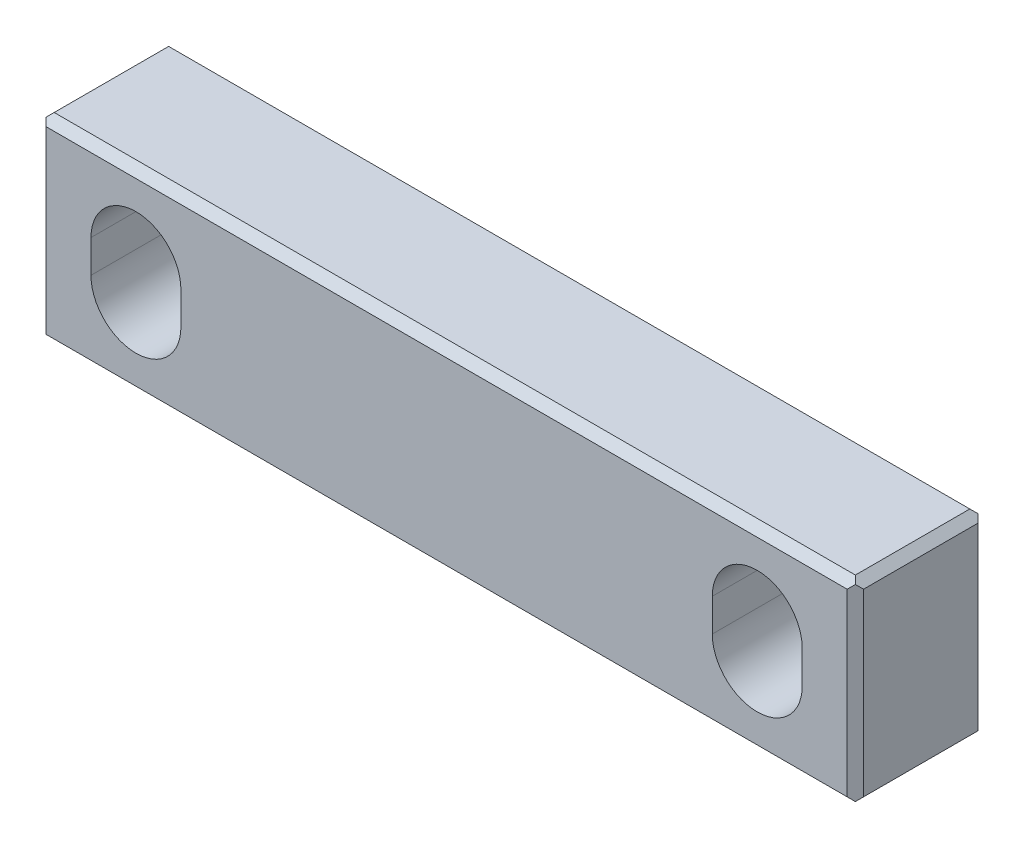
ISO-10303-21;
HEADER;
FILE_DESCRIPTION(('STEP AP214'),'2;1');
FILE_NAME('part.step','',(''),(''),'','','');
FILE_SCHEMA(('AUTOMOTIVE_DESIGN { 1 0 10303 214 1 1 1 1 }'));
ENDSEC;
DATA;
#1=APPLICATION_CONTEXT('core data for automotive mechanical design processes');
#2=APPLICATION_PROTOCOL_DEFINITION('international standard','automotive_design',2000,#1);
#3=PRODUCT_CONTEXT('',#1,'mechanical');
#4=PRODUCT('Part','Part','',(#3));
#5=PRODUCT_RELATED_PRODUCT_CATEGORY('part','',(#4));
#6=PRODUCT_DEFINITION_FORMATION('','',#4);
#7=PRODUCT_DEFINITION_CONTEXT('part definition',#1,'design');
#8=PRODUCT_DEFINITION('design','',#6,#7);
#9=PRODUCT_DEFINITION_SHAPE('','',#8);
#10=(LENGTH_UNIT() NAMED_UNIT(*) SI_UNIT(.MILLI.,.METRE.));
#11=(NAMED_UNIT(*) PLANE_ANGLE_UNIT() SI_UNIT($,.RADIAN.));
#12=(NAMED_UNIT(*) SI_UNIT($,.STERADIAN.) SOLID_ANGLE_UNIT());
#13=UNCERTAINTY_MEASURE_WITH_UNIT(LENGTH_MEASURE(1.E-05),#10,'distance_accuracy_value','');
#14=(GEOMETRIC_REPRESENTATION_CONTEXT(3) GLOBAL_UNCERTAINTY_ASSIGNED_CONTEXT((#13)) GLOBAL_UNIT_ASSIGNED_CONTEXT((#10,
#11,#12)) REPRESENTATION_CONTEXT('',''));
#15=CARTESIAN_POINT('',(0.,0.,0.));
#16=DIRECTION('',(0.,0.,1.));
#17=DIRECTION('',(1.,0.,0.));
#18=AXIS2_PLACEMENT_3D('',#15,#16,#17);
#19=CARTESIAN_POINT('',(396.970096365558,-9.9,173.27));
#20=DIRECTION('',(0.707106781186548,0.,-0.707106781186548));
#21=DIRECTION('',(-0.707106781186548,0.,-0.707106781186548));
#22=AXIS2_PLACEMENT_3D('',#19,#20,#21);
#23=PLANE('',#22);
#24=DIRECTION('',(-0.577350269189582,0.577350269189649,-0.577350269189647));
#25=VECTOR('',#24,1.);
#26=CARTESIAN_POINT('',(397.220096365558,-4.4,173.52));
#27=LINE('',#26,#25);
#28=CARTESIAN_POINT('',(397.220096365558,-4.4,173.52));
#29=VERTEX_POINT('',#28);
#30=CARTESIAN_POINT('',(396.970096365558,-4.15,173.27));
#31=VERTEX_POINT('',#30);
#32=EDGE_CURVE('E293',#29,#31,#27,.T.);
#33=ORIENTED_EDGE('',*,*,#32,.T.);
#34=DIRECTION('',(0.577350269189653,0.577350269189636,0.577350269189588));
#35=VECTOR('',#34,1.);
#36=CARTESIAN_POINT('',(396.720096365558,-4.4,173.02));
#37=LINE('',#36,#35);
#38=CARTESIAN_POINT('',(396.720096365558,-4.4,173.02));
#39=VERTEX_POINT('',#38);
#40=EDGE_CURVE('E300',#39,#31,#37,.T.);
#41=ORIENTED_EDGE('',*,*,#40,.F.);
#42=DIRECTION('',(0.,-1.,0.));
#43=VECTOR('',#42,1.);
#44=CARTESIAN_POINT('',(396.720096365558,-3.9,173.02));
#45=LINE('',#44,#43);
#46=CARTESIAN_POINT('',(396.720096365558,-15.4,173.02));
#47=VERTEX_POINT('',#46);
#48=EDGE_CURVE('E230',#47,#39,#45,.F.);
#49=ORIENTED_EDGE('',*,*,#48,.F.);
#50=DIRECTION('',(0.577350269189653,-0.577350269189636,0.577350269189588));
#51=VECTOR('',#50,1.);
#52=CARTESIAN_POINT('',(396.720096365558,-15.4,173.02));
#53=LINE('',#52,#51);
#54=CARTESIAN_POINT('',(396.970096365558,-15.65,173.27));
#55=VERTEX_POINT('',#54);
#56=EDGE_CURVE('E273',#47,#55,#53,.T.);
#57=ORIENTED_EDGE('',*,*,#56,.T.);
#58=DIRECTION('',(0.577350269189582,0.57735026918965,0.577350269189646));
#59=VECTOR('',#58,1.);
#60=CARTESIAN_POINT('',(396.970096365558,-15.65,173.27));
#61=LINE('',#60,#59);
#62=CARTESIAN_POINT('',(397.220096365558,-15.4,173.52));
#63=VERTEX_POINT('',#62);
#64=EDGE_CURVE('E275',#55,#63,#61,.T.);
#65=ORIENTED_EDGE('',*,*,#64,.T.);
#66=DIRECTION('',(0.,1.,0.));
#67=VECTOR('',#66,1.);
#68=CARTESIAN_POINT('',(397.220096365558,-82.9,173.52));
#69=LINE('',#68,#67);
#70=EDGE_CURVE('E243',#63,#29,#69,.T.);
#71=ORIENTED_EDGE('',*,*,#70,.T.);
#72=EDGE_LOOP('',(#33,#41,#49,#57,#65,#71));
#73=FACE_BOUND('',#72,.T.);
#74=ADVANCED_FACE('F16',(#73),#23,.F.);
#75=CARTESIAN_POINT('',(396.970096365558,-4.15,169.52));
#76=DIRECTION('',(-0.707106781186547,0.707106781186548,0.));
#77=DIRECTION('',(-0.707106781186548,-0.707106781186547,0.));
#78=AXIS2_PLACEMENT_3D('',#75,#76,#77);
#79=PLANE('',#78);
#80=DIRECTION('',(-0.577350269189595,-0.577350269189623,-0.57735026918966));
#81=VECTOR('',#80,1.);
#82=CARTESIAN_POINT('',(397.220096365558,-3.9,166.02));
#83=LINE('',#82,#81);
#84=CARTESIAN_POINT('',(397.220096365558,-3.9,166.02));
#85=VERTEX_POINT('',#84);
#86=CARTESIAN_POINT('',(396.970096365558,-4.15,165.77));
#87=VERTEX_POINT('',#86);
#88=EDGE_CURVE('E297',#85,#87,#83,.T.);
#89=ORIENTED_EDGE('',*,*,#88,.T.);
#90=DIRECTION('',(-0.577350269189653,-0.577350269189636,0.577350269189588));
#91=VECTOR('',#90,1.);
#92=CARTESIAN_POINT('',(396.970096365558,-4.15,165.77));
#93=LINE('',#92,#91);
#94=CARTESIAN_POINT('',(396.720096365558,-4.4,166.02));
#95=VERTEX_POINT('',#94);
#96=EDGE_CURVE('E295',#87,#95,#93,.T.);
#97=ORIENTED_EDGE('',*,*,#96,.T.);
#98=DIRECTION('',(0.,0.,1.));
#99=VECTOR('',#98,1.);
#100=CARTESIAN_POINT('',(396.720096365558,-4.4,173.52));
#101=LINE('',#100,#99);
#102=EDGE_CURVE('E227',#39,#95,#101,.F.);
#103=ORIENTED_EDGE('',*,*,#102,.F.);
#104=ORIENTED_EDGE('',*,*,#40,.T.);
#105=DIRECTION('',(0.577350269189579,0.577350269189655,-0.577350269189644));
#106=VECTOR('',#105,1.);
#107=CARTESIAN_POINT('',(396.970096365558,-4.15,173.27));
#108=LINE('',#107,#106);
#109=CARTESIAN_POINT('',(397.220096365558,-3.9,173.02));
#110=VERTEX_POINT('',#109);
#111=EDGE_CURVE('E291',#31,#110,#108,.T.);
#112=ORIENTED_EDGE('',*,*,#111,.T.);
#113=DIRECTION('',(0.,0.,1.));
#114=VECTOR('',#113,1.);
#115=CARTESIAN_POINT('',(397.220096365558,-3.9,173.52));
#116=LINE('',#115,#114);
#117=EDGE_CURVE('E221',#85,#110,#116,.T.);
#118=ORIENTED_EDGE('',*,*,#117,.F.);
#119=EDGE_LOOP('',(#89,#97,#103,#104,#112,#118));
#120=FACE_BOUND('',#119,.T.);
#121=ADVANCED_FACE('F405',(#120),#79,.T.);
#122=CARTESIAN_POINT('',(421.720096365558,-4.15,173.27));
#123=DIRECTION('',(0.,-0.707106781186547,-0.707106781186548));
#124=DIRECTION('',(0.,0.707106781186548,-0.707106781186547));
#125=AXIS2_PLACEMENT_3D('',#122,#123,#124);
#126=PLANE('',#125);
#127=DIRECTION('',(0.577350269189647,0.577350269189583,-0.577350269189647));
#128=VECTOR('',#127,1.);
#129=CARTESIAN_POINT('',(446.220096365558,-4.4,173.52));
#130=LINE('',#129,#128);
#131=CARTESIAN_POINT('',(446.220096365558,-4.4,173.52));
#132=VERTEX_POINT('',#131);
#133=CARTESIAN_POINT('',(446.470096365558,-4.15,173.27));
#134=VERTEX_POINT('',#133);
#135=EDGE_CURVE('E281',#132,#134,#130,.T.);
#136=ORIENTED_EDGE('',*,*,#135,.T.);
#137=DIRECTION('',(0.577350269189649,-0.577350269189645,0.577350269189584));
#138=VECTOR('',#137,1.);
#139=CARTESIAN_POINT('',(446.220096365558,-3.89999999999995,173.02));
#140=LINE('',#139,#138);
#141=CARTESIAN_POINT('',(446.220096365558,-3.9,173.02));
#142=VERTEX_POINT('',#141);
#143=EDGE_CURVE('E288',#142,#134,#140,.T.);
#144=ORIENTED_EDGE('',*,*,#143,.F.);
#145=DIRECTION('',(1.,0.,0.));
#146=VECTOR('',#145,1.);
#147=CARTESIAN_POINT('',(446.720096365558,-3.9,173.02));
#148=LINE('',#147,#146);
#149=EDGE_CURVE('E218',#110,#142,#148,.T.);
#150=ORIENTED_EDGE('',*,*,#149,.F.);
#151=ORIENTED_EDGE('',*,*,#111,.F.);
#152=ORIENTED_EDGE('',*,*,#32,.F.);
#153=DIRECTION('',(1.,0.,0.));
#154=VECTOR('',#153,1.);
#155=CARTESIAN_POINT('',(411.720096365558,-4.4,173.52));
#156=LINE('',#155,#154);
#157=EDGE_CURVE('E241',#29,#132,#156,.T.);
#158=ORIENTED_EDGE('',*,*,#157,.T.);
#159=EDGE_LOOP('',(#136,#144,#150,#151,#152,#158));
#160=FACE_BOUND('',#159,.T.);
#161=ADVANCED_FACE('F424',(#160),#126,.F.);
#162=CARTESIAN_POINT('',(446.470096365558,-4.15,169.52));
#163=DIRECTION('',(0.707106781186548,0.707106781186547,0.));
#164=DIRECTION('',(-0.707106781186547,0.707106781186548,0.));
#165=AXIS2_PLACEMENT_3D('',#162,#163,#164);
#166=PLANE('',#165);
#167=DIRECTION('',(-0.577350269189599,0.577350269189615,-0.577350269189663));
#168=VECTOR('',#167,1.);
#169=CARTESIAN_POINT('',(446.720096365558,-4.4,166.02));
#170=LINE('',#169,#168);
#171=CARTESIAN_POINT('',(446.720096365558,-4.4,166.02));
#172=VERTEX_POINT('',#171);
#173=CARTESIAN_POINT('',(446.470096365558,-4.15,165.77));
#174=VERTEX_POINT('',#173);
#175=EDGE_CURVE('E285',#172,#174,#170,.T.);
#176=ORIENTED_EDGE('',*,*,#175,.T.);
#177=DIRECTION('',(-0.577350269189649,0.577350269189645,0.577350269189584));
#178=VECTOR('',#177,1.);
#179=CARTESIAN_POINT('',(446.470096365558,-4.15,165.77));
#180=LINE('',#179,#178);
#181=CARTESIAN_POINT('',(446.220096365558,-3.9,166.02));
#182=VERTEX_POINT('',#181);
#183=EDGE_CURVE('E283',#174,#182,#180,.T.);
#184=ORIENTED_EDGE('',*,*,#183,.T.);
#185=DIRECTION('',(0.,0.,1.));
#186=VECTOR('',#185,1.);
#187=CARTESIAN_POINT('',(446.220096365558,-3.9,173.52));
#188=LINE('',#187,#186);
#189=EDGE_CURVE('E224',#142,#182,#188,.F.);
#190=ORIENTED_EDGE('',*,*,#189,.F.);
#191=ORIENTED_EDGE('',*,*,#143,.T.);
#192=DIRECTION('',(0.577350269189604,-0.577350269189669,-0.577350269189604));
#193=VECTOR('',#192,1.);
#194=CARTESIAN_POINT('',(446.470096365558,-4.15,173.27));
#195=LINE('',#194,#193);
#196=CARTESIAN_POINT('',(446.720096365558,-4.4,173.02));
#197=VERTEX_POINT('',#196);
#198=EDGE_CURVE('E279',#134,#197,#195,.T.);
#199=ORIENTED_EDGE('',*,*,#198,.T.);
#200=DIRECTION('',(0.,0.,1.));
#201=VECTOR('',#200,1.);
#202=CARTESIAN_POINT('',(446.720096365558,-4.4,173.52));
#203=LINE('',#202,#201);
#204=EDGE_CURVE('E212',#172,#197,#203,.T.);
#205=ORIENTED_EDGE('',*,*,#204,.F.);
#206=EDGE_LOOP('',(#176,#184,#190,#191,#199,#205));
#207=FACE_BOUND('',#206,.T.);
#208=ADVANCED_FACE('F371',(#207),#166,.T.);
#209=CARTESIAN_POINT('',(446.470096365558,-9.9,173.27));
#210=DIRECTION('',(-0.707106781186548,0.,-0.707106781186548));
#211=DIRECTION('',(-0.707106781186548,0.,0.707106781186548));
#212=AXIS2_PLACEMENT_3D('',#209,#210,#211);
#213=PLANE('',#212);
#214=DIRECTION('',(0.577350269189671,-0.577350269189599,-0.577350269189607));
#215=VECTOR('',#214,1.);
#216=CARTESIAN_POINT('',(446.220096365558,-15.4,173.52));
#217=LINE('',#216,#215);
#218=CARTESIAN_POINT('',(446.220096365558,-15.4,173.52));
#219=VERTEX_POINT('',#218);
#220=CARTESIAN_POINT('',(446.470096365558,-15.65,173.27));
#221=VERTEX_POINT('',#220);
#222=EDGE_CURVE('E277',#219,#221,#217,.T.);
#223=ORIENTED_EDGE('',*,*,#222,.T.);
#224=DIRECTION('',(-0.577350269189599,-0.577350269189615,0.577350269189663));
#225=VECTOR('',#224,1.);
#226=CARTESIAN_POINT('',(446.720096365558,-15.4,173.02));
#227=LINE('',#226,#225);
#228=CARTESIAN_POINT('',(446.720096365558,-15.4,173.02));
#229=VERTEX_POINT('',#228);
#230=EDGE_CURVE('E264',#229,#221,#227,.T.);
#231=ORIENTED_EDGE('',*,*,#230,.F.);
#232=DIRECTION('',(0.,1.,0.));
#233=VECTOR('',#232,1.);
#234=CARTESIAN_POINT('',(446.720096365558,-15.9,173.02));
#235=LINE('',#234,#233);
#236=EDGE_CURVE('E209',#197,#229,#235,.F.);
#237=ORIENTED_EDGE('',*,*,#236,.F.);
#238=ORIENTED_EDGE('',*,*,#198,.F.);
#239=ORIENTED_EDGE('',*,*,#135,.F.);
#240=DIRECTION('',(0.,1.,0.));
#241=VECTOR('',#240,1.);
#242=CARTESIAN_POINT('',(446.220096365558,-82.9,173.52));
#243=LINE('',#242,#241);
#244=EDGE_CURVE('E239',#132,#219,#243,.F.);
#245=ORIENTED_EDGE('',*,*,#244,.T.);
#246=EDGE_LOOP('',(#223,#231,#237,#238,#239,#245));
#247=FACE_BOUND('',#246,.T.);
#248=ADVANCED_FACE('F414',(#247),#213,.F.);
#249=CARTESIAN_POINT('',(421.720096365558,-15.65,173.27));
#250=DIRECTION('',(0.,0.707106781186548,-0.707106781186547));
#251=DIRECTION('',(0.,0.707106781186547,0.707106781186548));
#252=AXIS2_PLACEMENT_3D('',#249,#250,#251);
#253=PLANE('',#252);
#254=ORIENTED_EDGE('',*,*,#64,.F.);
#255=DIRECTION('',(0.577350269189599,-0.577350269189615,-0.577350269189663));
#256=VECTOR('',#255,1.);
#257=CARTESIAN_POINT('',(396.970096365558,-15.65,173.27));
#258=LINE('',#257,#256);
#259=CARTESIAN_POINT('',(397.220096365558,-15.9,173.02));
#260=VERTEX_POINT('',#259);
#261=EDGE_CURVE('E271',#55,#260,#258,.T.);
#262=ORIENTED_EDGE('',*,*,#261,.T.);
#263=DIRECTION('',(1.,0.,0.));
#264=VECTOR('',#263,1.);
#265=CARTESIAN_POINT('',(396.720096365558,-15.9,173.02));
#266=LINE('',#265,#264);
#267=CARTESIAN_POINT('',(446.220096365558,-15.9,173.02));
#268=VERTEX_POINT('',#267);
#269=EDGE_CURVE('E206',#268,#260,#266,.F.);
#270=ORIENTED_EDGE('',*,*,#269,.F.);
#271=DIRECTION('',(-0.577350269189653,-0.577350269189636,-0.577350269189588));
#272=VECTOR('',#271,1.);
#273=CARTESIAN_POINT('',(446.470096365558,-15.65,173.27));
#274=LINE('',#273,#272);
#275=EDGE_CURVE('E261',#221,#268,#274,.T.);
#276=ORIENTED_EDGE('',*,*,#275,.F.);
#277=ORIENTED_EDGE('',*,*,#222,.F.);
#278=DIRECTION('',(1.,0.,0.));
#279=VECTOR('',#278,1.);
#280=CARTESIAN_POINT('',(411.720096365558,-15.4,173.52));
#281=LINE('',#280,#279);
#282=EDGE_CURVE('E236',#219,#63,#281,.F.);
#283=ORIENTED_EDGE('',*,*,#282,.T.);
#284=EDGE_LOOP('',(#254,#262,#270,#276,#277,#283));
#285=FACE_BOUND('',#284,.T.);
#286=ADVANCED_FACE('F420',(#285),#253,.F.);
#287=CARTESIAN_POINT('',(396.970096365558,-15.65,169.52));
#288=DIRECTION('',(0.707106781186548,0.707106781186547,0.));
#289=DIRECTION('',(-0.707106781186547,0.707106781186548,0.));
#290=AXIS2_PLACEMENT_3D('',#287,#288,#289);
#291=PLANE('',#290);
#292=DIRECTION('',(-0.577350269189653,0.577350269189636,0.577350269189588));
#293=VECTOR('',#292,1.);
#294=CARTESIAN_POINT('',(396.970096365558,-15.65,165.77));
#295=LINE('',#294,#293);
#296=CARTESIAN_POINT('',(396.970096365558,-15.65,165.77));
#297=VERTEX_POINT('',#296);
#298=CARTESIAN_POINT('',(396.720096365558,-15.4,166.02));
#299=VERTEX_POINT('',#298);
#300=EDGE_CURVE('E267',#297,#299,#295,.T.);
#301=ORIENTED_EDGE('',*,*,#300,.F.);
#302=DIRECTION('',(-0.577350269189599,0.577350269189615,-0.577350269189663));
#303=VECTOR('',#302,1.);
#304=CARTESIAN_POINT('',(397.220096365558,-15.9,166.02));
#305=LINE('',#304,#303);
#306=CARTESIAN_POINT('',(397.220096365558,-15.9,166.02));
#307=VERTEX_POINT('',#306);
#308=EDGE_CURVE('E269',#307,#297,#305,.T.);
#309=ORIENTED_EDGE('',*,*,#308,.F.);
#310=DIRECTION('',(0.,0.,-1.));
#311=VECTOR('',#310,1.);
#312=CARTESIAN_POINT('',(397.220096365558,-15.9,173.52));
#313=LINE('',#312,#311);
#314=EDGE_CURVE('E203',#260,#307,#313,.T.);
#315=ORIENTED_EDGE('',*,*,#314,.F.);
#316=ORIENTED_EDGE('',*,*,#261,.F.);
#317=ORIENTED_EDGE('',*,*,#56,.F.);
#318=DIRECTION('',(0.,0.,1.));
#319=VECTOR('',#318,1.);
#320=CARTESIAN_POINT('',(396.720096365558,-15.4,173.52));
#321=LINE('',#320,#319);
#322=EDGE_CURVE('E233',#299,#47,#321,.T.);
#323=ORIENTED_EDGE('',*,*,#322,.F.);
#324=EDGE_LOOP('',(#301,#309,#315,#316,#317,#323));
#325=FACE_BOUND('',#324,.T.);
#326=ADVANCED_FACE('F395',(#325),#291,.F.);
#327=CARTESIAN_POINT('',(446.470096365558,-15.65,169.52));
#328=DIRECTION('',(0.707106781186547,-0.707106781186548,0.));
#329=DIRECTION('',(0.707106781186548,0.707106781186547,0.));
#330=AXIS2_PLACEMENT_3D('',#327,#328,#329);
#331=PLANE('',#330);
#332=DIRECTION('',(0.577350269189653,0.577350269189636,-0.577350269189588));
#333=VECTOR('',#332,1.);
#334=CARTESIAN_POINT('',(446.220096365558,-15.9,166.02));
#335=LINE('',#334,#333);
#336=CARTESIAN_POINT('',(446.220096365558,-15.9,166.02));
#337=VERTEX_POINT('',#336);
#338=CARTESIAN_POINT('',(446.470096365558,-15.65,165.77));
#339=VERTEX_POINT('',#338);
#340=EDGE_CURVE('E258',#337,#339,#335,.T.);
#341=ORIENTED_EDGE('',*,*,#340,.T.);
#342=DIRECTION('',(0.577350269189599,0.577350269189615,0.577350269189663));
#343=VECTOR('',#342,1.);
#344=CARTESIAN_POINT('',(446.470096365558,-15.65,165.77));
#345=LINE('',#344,#343);
#346=CARTESIAN_POINT('',(446.720096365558,-15.4,166.02));
#347=VERTEX_POINT('',#346);
#348=EDGE_CURVE('E245',#339,#347,#345,.T.);
#349=ORIENTED_EDGE('',*,*,#348,.T.);
#350=DIRECTION('',(0.,0.,1.));
#351=VECTOR('',#350,1.);
#352=CARTESIAN_POINT('',(446.720096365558,-15.4,173.52));
#353=LINE('',#352,#351);
#354=EDGE_CURVE('E215',#229,#347,#353,.F.);
#355=ORIENTED_EDGE('',*,*,#354,.F.);
#356=ORIENTED_EDGE('',*,*,#230,.T.);
#357=ORIENTED_EDGE('',*,*,#275,.T.);
#358=DIRECTION('',(0.,0.,-1.));
#359=VECTOR('',#358,1.);
#360=CARTESIAN_POINT('',(446.220096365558,-15.9,173.52));
#361=LINE('',#360,#359);
#362=EDGE_CURVE('E192',#337,#268,#361,.F.);
#363=ORIENTED_EDGE('',*,*,#362,.F.);
#364=EDGE_LOOP('',(#341,#349,#355,#356,#357,#363));
#365=FACE_BOUND('',#364,.T.);
#366=ADVANCED_FACE('F383',(#365),#331,.T.);
#367=CARTESIAN_POINT('',(411.720096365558,-82.9,173.52));
#368=DIRECTION('',(0.,0.,-1.));
#369=DIRECTION('',(0.,1.,0.));
#370=AXIS2_PLACEMENT_3D('',#367,#368,#369);
#371=PLANE('',#370);
#372=ORIENTED_EDGE('',*,*,#244,.F.);
#373=ORIENTED_EDGE('',*,*,#157,.F.);
#374=ORIENTED_EDGE('',*,*,#70,.F.);
#375=ORIENTED_EDGE('',*,*,#282,.F.);
#376=EDGE_LOOP('',(#372,#373,#374,#375));
#377=FACE_BOUND('',#376,.T.);
#378=DIRECTION('',(0.,-1.,0.));
#379=VECTOR('',#378,1.);
#380=CARTESIAN_POINT('',(399.970096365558,-8.9,173.52));
#381=LINE('',#380,#379);
#382=CARTESIAN_POINT('',(399.970096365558,-10.9,173.52));
#383=VERTEX_POINT('',#382);
#384=CARTESIAN_POINT('',(399.970096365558,-8.9,173.52));
#385=VERTEX_POINT('',#384);
#386=EDGE_CURVE('E250',#383,#385,#381,.F.);
#387=ORIENTED_EDGE('',*,*,#386,.T.);
#388=CARTESIAN_POINT('',(402.720096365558,-8.9,173.52));
#389=DIRECTION('',(0.,0.,-1.));
#390=DIRECTION('',(0.,1.,0.));
#391=AXIS2_PLACEMENT_3D('',#388,#389,#390);
#392=CIRCLE('',#391,2.75);
#393=CARTESIAN_POINT('',(405.470096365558,-8.9,173.52));
#394=VERTEX_POINT('',#393);
#395=EDGE_CURVE('E320',#385,#394,#392,.T.);
#396=ORIENTED_EDGE('',*,*,#395,.T.);
#397=DIRECTION('',(0.,1.,0.));
#398=VECTOR('',#397,1.);
#399=CARTESIAN_POINT('',(405.470096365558,-10.9,173.52));
#400=LINE('',#399,#398);
#401=CARTESIAN_POINT('',(405.470096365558,-10.9,173.52));
#402=VERTEX_POINT('',#401);
#403=EDGE_CURVE('E246',#394,#402,#400,.F.);
#404=ORIENTED_EDGE('',*,*,#403,.T.);
#405=CARTESIAN_POINT('',(402.720096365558,-10.9,173.52));
#406=DIRECTION('',(0.,0.,-1.));
#407=DIRECTION('',(0.,1.,0.));
#408=AXIS2_PLACEMENT_3D('',#405,#406,#407);
#409=CIRCLE('',#408,2.75);
#410=EDGE_CURVE('E316',#402,#383,#409,.T.);
#411=ORIENTED_EDGE('',*,*,#410,.T.);
#412=EDGE_LOOP('',(#387,#396,#404,#411));
#413=FACE_BOUND('',#412,.T.);
#414=CARTESIAN_POINT('',(440.720096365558,-10.9,173.52));
#415=DIRECTION('',(0.,0.,-1.));
#416=DIRECTION('',(0.,1.,0.));
#417=AXIS2_PLACEMENT_3D('',#414,#415,#416);
#418=CIRCLE('',#417,2.75);
#419=CARTESIAN_POINT('',(443.470096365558,-10.9,173.52));
#420=VERTEX_POINT('',#419);
#421=CARTESIAN_POINT('',(437.970096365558,-10.9,173.52));
#422=VERTEX_POINT('',#421);
#423=EDGE_CURVE('E19',#420,#422,#418,.T.);
#424=ORIENTED_EDGE('',*,*,#423,.T.);
#425=DIRECTION('',(0.,-1.,0.));
#426=VECTOR('',#425,1.);
#427=CARTESIAN_POINT('',(437.970096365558,-8.9,173.52));
#428=LINE('',#427,#426);
#429=CARTESIAN_POINT('',(437.970096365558,-8.9,173.52));
#430=VERTEX_POINT('',#429);
#431=EDGE_CURVE('E255',#422,#430,#428,.F.);
#432=ORIENTED_EDGE('',*,*,#431,.T.);
#433=CARTESIAN_POINT('',(440.720096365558,-8.9,173.52));
#434=DIRECTION('',(0.,0.,-1.));
#435=DIRECTION('',(0.,1.,0.));
#436=AXIS2_PLACEMENT_3D('',#433,#434,#435);
#437=CIRCLE('',#436,2.75);
#438=CARTESIAN_POINT('',(443.470096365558,-8.9,173.52));
#439=VERTEX_POINT('',#438);
#440=EDGE_CURVE('E179',#430,#439,#437,.T.);
#441=ORIENTED_EDGE('',*,*,#440,.T.);
#442=DIRECTION('',(0.,1.,0.));
#443=VECTOR('',#442,1.);
#444=CARTESIAN_POINT('',(443.470096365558,-10.9,173.52));
#445=LINE('',#444,#443);
#446=EDGE_CURVE('E174',#439,#420,#445,.F.);
#447=ORIENTED_EDGE('',*,*,#446,.T.);
#448=EDGE_LOOP('',(#424,#432,#441,#447));
#449=FACE_BOUND('',#448,.T.);
#450=ADVANCED_FACE('F176',(#377,#413,#449),#371,.F.);
#451=CARTESIAN_POINT('',(396.720096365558,-3.9,173.52));
#452=DIRECTION('',(-1.,0.,0.));
#453=DIRECTION('',(0.,-1.,0.));
#454=AXIS2_PLACEMENT_3D('',#451,#452,#453);
#455=PLANE('',#454);
#456=ORIENTED_EDGE('',*,*,#102,.T.);
#457=DIRECTION('',(0.,1.,0.));
#458=VECTOR('',#457,1.);
#459=CARTESIAN_POINT('',(396.720096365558,-9.9,166.02));
#460=LINE('',#459,#458);
#461=EDGE_CURVE('E318',#299,#95,#460,.T.);
#462=ORIENTED_EDGE('',*,*,#461,.F.);
#463=ORIENTED_EDGE('',*,*,#322,.T.);
#464=ORIENTED_EDGE('',*,*,#48,.T.);
#465=EDGE_LOOP('',(#456,#462,#463,#464));
#466=FACE_BOUND('',#465,.T.);
#467=ADVANCED_FACE('F400',(#466),#455,.T.);
#468=CARTESIAN_POINT('',(446.720096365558,-3.9,173.52));
#469=DIRECTION('',(0.,1.,0.));
#470=DIRECTION('',(0.,0.,1.));
#471=AXIS2_PLACEMENT_3D('',#468,#469,#470);
#472=PLANE('',#471);
#473=ORIENTED_EDGE('',*,*,#117,.T.);
#474=ORIENTED_EDGE('',*,*,#149,.T.);
#475=ORIENTED_EDGE('',*,*,#189,.T.);
#476=DIRECTION('',(1.,0.,0.));
#477=VECTOR('',#476,1.);
#478=CARTESIAN_POINT('',(421.720096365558,-3.9,166.02));
#479=LINE('',#478,#477);
#480=EDGE_CURVE('E335',#85,#182,#479,.T.);
#481=ORIENTED_EDGE('',*,*,#480,.F.);
#482=EDGE_LOOP('',(#473,#474,#475,#481));
#483=FACE_BOUND('',#482,.T.);
#484=ADVANCED_FACE('F410',(#483),#472,.T.);
#485=CARTESIAN_POINT('',(446.720096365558,-15.9,173.52));
#486=DIRECTION('',(1.,0.,0.));
#487=DIRECTION('',(0.,1.,0.));
#488=AXIS2_PLACEMENT_3D('',#485,#486,#487);
#489=PLANE('',#488);
#490=ORIENTED_EDGE('',*,*,#204,.T.);
#491=ORIENTED_EDGE('',*,*,#236,.T.);
#492=ORIENTED_EDGE('',*,*,#354,.T.);
#493=DIRECTION('',(0.,1.,0.));
#494=VECTOR('',#493,1.);
#495=CARTESIAN_POINT('',(446.720096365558,-9.9,166.02));
#496=LINE('',#495,#494);
#497=EDGE_CURVE('E341',#172,#347,#496,.F.);
#498=ORIENTED_EDGE('',*,*,#497,.F.);
#499=EDGE_LOOP('',(#490,#491,#492,#498));
#500=FACE_BOUND('',#499,.T.);
#501=ADVANCED_FACE('F377',(#500),#489,.T.);
#502=CARTESIAN_POINT('',(396.720096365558,-15.9,173.52));
#503=DIRECTION('',(0.,-1.,0.));
#504=DIRECTION('',(0.,0.,-1.));
#505=AXIS2_PLACEMENT_3D('',#502,#503,#504);
#506=PLANE('',#505);
#507=DIRECTION('',(1.,0.,0.));
#508=VECTOR('',#507,1.);
#509=CARTESIAN_POINT('',(421.720096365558,-15.9,166.02));
#510=LINE('',#509,#508);
#511=EDGE_CURVE('E345',#337,#307,#510,.F.);
#512=ORIENTED_EDGE('',*,*,#511,.F.);
#513=ORIENTED_EDGE('',*,*,#362,.T.);
#514=ORIENTED_EDGE('',*,*,#269,.T.);
#515=ORIENTED_EDGE('',*,*,#314,.T.);
#516=EDGE_LOOP('',(#512,#513,#514,#515));
#517=FACE_BOUND('',#516,.T.);
#518=ADVANCED_FACE('F387',(#517),#506,.T.);
#519=CARTESIAN_POINT('',(440.720096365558,-10.9,174.3200024));
#520=DIRECTION('',(0.,0.,-1.));
#521=DIRECTION('',(0.,1.,0.));
#522=AXIS2_PLACEMENT_3D('',#519,#520,#521);
#523=CYLINDRICAL_SURFACE('',#522,2.75);
#524=ORIENTED_EDGE('',*,*,#423,.F.);
#525=DIRECTION('',(0.,0.,1.));
#526=VECTOR('',#525,1.);
#527=CARTESIAN_POINT('',(443.470096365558,-10.9,174.3200024));
#528=LINE('',#527,#526);
#529=CARTESIAN_POINT('',(443.470096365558,-10.9,165.52));
#530=VERTEX_POINT('',#529);
#531=EDGE_CURVE('E183',#420,#530,#528,.F.);
#532=ORIENTED_EDGE('',*,*,#531,.T.);
#533=CARTESIAN_POINT('',(440.720096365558,-10.9,165.52));
#534=DIRECTION('',(0.,0.,-1.));
#535=DIRECTION('',(0.,1.,0.));
#536=AXIS2_PLACEMENT_3D('',#533,#534,#535);
#537=CIRCLE('',#536,2.75);
#538=CARTESIAN_POINT('',(437.970096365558,-10.9,165.52));
#539=VERTEX_POINT('',#538);
#540=EDGE_CURVE('E313',#539,#530,#537,.F.);
#541=ORIENTED_EDGE('',*,*,#540,.F.);
#542=DIRECTION('',(0.,0.,1.));
#543=VECTOR('',#542,1.);
#544=CARTESIAN_POINT('',(437.970096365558,-10.9,174.3200024));
#545=LINE('',#544,#543);
#546=EDGE_CURVE('E190',#539,#422,#545,.T.);
#547=ORIENTED_EDGE('',*,*,#546,.T.);
#548=EDGE_LOOP('',(#524,#532,#541,#547));
#549=FACE_BOUND('',#548,.T.);
#550=ADVANCED_FACE('F187',(#549),#523,.F.);
#551=CARTESIAN_POINT('',(443.470096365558,-10.9,174.3200024));
#552=DIRECTION('',(1.,0.,0.));
#553=DIRECTION('',(0.,1.,0.));
#554=AXIS2_PLACEMENT_3D('',#551,#552,#553);
#555=PLANE('',#554);
#556=ORIENTED_EDGE('',*,*,#531,.F.);
#557=ORIENTED_EDGE('',*,*,#446,.F.);
#558=DIRECTION('',(0.,0.,-1.));
#559=VECTOR('',#558,1.);
#560=CARTESIAN_POINT('',(443.470096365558,-8.9,174.3200024));
#561=LINE('',#560,#559);
#562=CARTESIAN_POINT('',(443.470096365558,-8.9,165.52));
#563=VERTEX_POINT('',#562);
#564=EDGE_CURVE('E196',#439,#563,#561,.T.);
#565=ORIENTED_EDGE('',*,*,#564,.T.);
#566=DIRECTION('',(0.,1.,0.));
#567=VECTOR('',#566,1.);
#568=CARTESIAN_POINT('',(443.470096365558,-82.9,165.52));
#569=LINE('',#568,#567);
#570=EDGE_CURVE('E195',#530,#563,#569,.T.);
#571=ORIENTED_EDGE('',*,*,#570,.F.);
#572=EDGE_LOOP('',(#556,#557,#565,#571));
#573=FACE_BOUND('',#572,.T.);
#574=ADVANCED_FACE('F193',(#573),#555,.F.);
#575=CARTESIAN_POINT('',(440.720096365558,-8.9,174.3200024));
#576=DIRECTION('',(0.,0.,-1.));
#577=DIRECTION('',(0.,1.,0.));
#578=AXIS2_PLACEMENT_3D('',#575,#576,#577);
#579=CYLINDRICAL_SURFACE('',#578,2.75);
#580=ORIENTED_EDGE('',*,*,#440,.F.);
#581=DIRECTION('',(0.,0.,1.));
#582=VECTOR('',#581,1.);
#583=CARTESIAN_POINT('',(437.970096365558,-8.9,174.3200024));
#584=LINE('',#583,#582);
#585=CARTESIAN_POINT('',(437.970096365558,-8.9,165.52));
#586=VERTEX_POINT('',#585);
#587=EDGE_CURVE('E249',#430,#586,#584,.F.);
#588=ORIENTED_EDGE('',*,*,#587,.T.);
#589=CARTESIAN_POINT('',(440.720096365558,-8.9,165.52));
#590=DIRECTION('',(0.,0.,-1.));
#591=DIRECTION('',(0.,1.,0.));
#592=AXIS2_PLACEMENT_3D('',#589,#590,#591);
#593=CIRCLE('',#592,2.75);
#594=EDGE_CURVE('E310',#563,#586,#593,.F.);
#595=ORIENTED_EDGE('',*,*,#594,.F.);
#596=ORIENTED_EDGE('',*,*,#564,.F.);
#597=EDGE_LOOP('',(#580,#588,#595,#596));
#598=FACE_BOUND('',#597,.T.);
#599=ADVANCED_FACE('F456',(#598),#579,.F.);
#600=CARTESIAN_POINT('',(437.970096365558,-8.9,174.3200024));
#601=DIRECTION('',(-1.,0.,0.));
#602=DIRECTION('',(0.,-1.,0.));
#603=AXIS2_PLACEMENT_3D('',#600,#601,#602);
#604=PLANE('',#603);
#605=ORIENTED_EDGE('',*,*,#587,.F.);
#606=ORIENTED_EDGE('',*,*,#431,.F.);
#607=ORIENTED_EDGE('',*,*,#546,.F.);
#608=DIRECTION('',(0.,1.,0.));
#609=VECTOR('',#608,1.);
#610=CARTESIAN_POINT('',(437.970096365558,-82.9,165.52));
#611=LINE('',#610,#609);
#612=EDGE_CURVE('E312',#586,#539,#611,.F.);
#613=ORIENTED_EDGE('',*,*,#612,.F.);
#614=EDGE_LOOP('',(#605,#606,#607,#613));
#615=FACE_BOUND('',#614,.T.);
#616=ADVANCED_FACE('F458',(#615),#604,.F.);
#617=CARTESIAN_POINT('',(405.470096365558,-10.9,174.3200024));
#618=DIRECTION('',(1.,0.,0.));
#619=DIRECTION('',(0.,1.,0.));
#620=AXIS2_PLACEMENT_3D('',#617,#618,#619);
#621=PLANE('',#620);
#622=DIRECTION('',(0.,0.,-1.));
#623=VECTOR('',#622,1.);
#624=CARTESIAN_POINT('',(405.470096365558,-10.9,174.3200024));
#625=LINE('',#624,#623);
#626=CARTESIAN_POINT('',(405.470096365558,-10.9,165.52));
#627=VERTEX_POINT('',#626);
#628=EDGE_CURVE('E319',#627,#402,#625,.F.);
#629=ORIENTED_EDGE('',*,*,#628,.T.);
#630=ORIENTED_EDGE('',*,*,#403,.F.);
#631=DIRECTION('',(0.,0.,-1.));
#632=VECTOR('',#631,1.);
#633=CARTESIAN_POINT('',(405.470096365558,-8.9,174.3200024));
#634=LINE('',#633,#632);
#635=CARTESIAN_POINT('',(405.470096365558,-8.9,165.52));
#636=VERTEX_POINT('',#635);
#637=EDGE_CURVE('E248',#394,#636,#634,.T.);
#638=ORIENTED_EDGE('',*,*,#637,.T.);
#639=DIRECTION('',(0.,1.,0.));
#640=VECTOR('',#639,1.);
#641=CARTESIAN_POINT('',(405.470096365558,-82.9,165.52));
#642=LINE('',#641,#640);
#643=EDGE_CURVE('E309',#627,#636,#642,.T.);
#644=ORIENTED_EDGE('',*,*,#643,.F.);
#645=EDGE_LOOP('',(#629,#630,#638,#644));
#646=FACE_BOUND('',#645,.T.);
#647=ADVANCED_FACE('F444',(#646),#621,.F.);
#648=CARTESIAN_POINT('',(402.720096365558,-8.9,174.3200024));
#649=DIRECTION('',(0.,0.,-1.));
#650=DIRECTION('',(0.,1.,0.));
#651=AXIS2_PLACEMENT_3D('',#648,#649,#650);
#652=CYLINDRICAL_SURFACE('',#651,2.75);
#653=ORIENTED_EDGE('',*,*,#395,.F.);
#654=DIRECTION('',(0.,0.,1.));
#655=VECTOR('',#654,1.);
#656=CARTESIAN_POINT('',(399.970096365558,-8.9,174.3200024));
#657=LINE('',#656,#655);
#658=CARTESIAN_POINT('',(399.970096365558,-8.9,165.52));
#659=VERTEX_POINT('',#658);
#660=EDGE_CURVE('E254',#385,#659,#657,.F.);
#661=ORIENTED_EDGE('',*,*,#660,.T.);
#662=CARTESIAN_POINT('',(402.720096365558,-8.9,165.52));
#663=DIRECTION('',(0.,0.,-1.));
#664=DIRECTION('',(0.,1.,0.));
#665=AXIS2_PLACEMENT_3D('',#662,#663,#664);
#666=CIRCLE('',#665,2.75);
#667=EDGE_CURVE('E307',#636,#659,#666,.F.);
#668=ORIENTED_EDGE('',*,*,#667,.F.);
#669=ORIENTED_EDGE('',*,*,#637,.F.);
#670=EDGE_LOOP('',(#653,#661,#668,#669));
#671=FACE_BOUND('',#670,.T.);
#672=ADVANCED_FACE('F440',(#671),#652,.F.);
#673=CARTESIAN_POINT('',(399.970096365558,-8.9,174.3200024));
#674=DIRECTION('',(-1.,0.,0.));
#675=DIRECTION('',(0.,-1.,0.));
#676=AXIS2_PLACEMENT_3D('',#673,#674,#675);
#677=PLANE('',#676);
#678=DIRECTION('',(0.,0.,-1.));
#679=VECTOR('',#678,1.);
#680=CARTESIAN_POINT('',(399.970096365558,-10.9,174.3200024));
#681=LINE('',#680,#679);
#682=CARTESIAN_POINT('',(399.970096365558,-10.9,165.52));
#683=VERTEX_POINT('',#682);
#684=EDGE_CURVE('E253',#383,#683,#681,.T.);
#685=ORIENTED_EDGE('',*,*,#684,.T.);
#686=DIRECTION('',(0.,1.,0.));
#687=VECTOR('',#686,1.);
#688=CARTESIAN_POINT('',(399.970096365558,-82.9,165.52));
#689=LINE('',#688,#687);
#690=EDGE_CURVE('E306',#659,#683,#689,.F.);
#691=ORIENTED_EDGE('',*,*,#690,.F.);
#692=ORIENTED_EDGE('',*,*,#660,.F.);
#693=ORIENTED_EDGE('',*,*,#386,.F.);
#694=EDGE_LOOP('',(#685,#691,#692,#693));
#695=FACE_BOUND('',#694,.T.);
#696=ADVANCED_FACE('F437',(#695),#677,.F.);
#697=CARTESIAN_POINT('',(402.720096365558,-10.9,174.3200024));
#698=DIRECTION('',(0.,0.,-1.));
#699=DIRECTION('',(0.,1.,0.));
#700=AXIS2_PLACEMENT_3D('',#697,#698,#699);
#701=CYLINDRICAL_SURFACE('',#700,2.75);
#702=ORIENTED_EDGE('',*,*,#410,.F.);
#703=ORIENTED_EDGE('',*,*,#628,.F.);
#704=CARTESIAN_POINT('',(402.720096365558,-10.9,165.52));
#705=DIRECTION('',(0.,0.,-1.));
#706=DIRECTION('',(0.,1.,0.));
#707=AXIS2_PLACEMENT_3D('',#704,#705,#706);
#708=CIRCLE('',#707,2.75);
#709=EDGE_CURVE('E303',#683,#627,#708,.F.);
#710=ORIENTED_EDGE('',*,*,#709,.F.);
#711=ORIENTED_EDGE('',*,*,#684,.F.);
#712=EDGE_LOOP('',(#702,#703,#710,#711));
#713=FACE_BOUND('',#712,.T.);
#714=ADVANCED_FACE('F448',(#713),#701,.F.);
#715=CARTESIAN_POINT('',(396.970096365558,-9.9,165.77));
#716=DIRECTION('',(-0.707106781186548,0.,-0.707106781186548));
#717=DIRECTION('',(-0.707106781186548,0.,0.707106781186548));
#718=AXIS2_PLACEMENT_3D('',#715,#716,#717);
#719=PLANE('',#718);
#720=ORIENTED_EDGE('',*,*,#96,.F.);
#721=DIRECTION('',(-0.577350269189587,0.577350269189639,0.577350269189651));
#722=VECTOR('',#721,1.);
#723=CARTESIAN_POINT('',(397.220096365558,-4.4,165.52));
#724=LINE('',#723,#722);
#725=CARTESIAN_POINT('',(397.220096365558,-4.4,165.52));
#726=VERTEX_POINT('',#725);
#727=EDGE_CURVE('E332',#726,#87,#724,.T.);
#728=ORIENTED_EDGE('',*,*,#727,.F.);
#729=DIRECTION('',(0.,1.,0.));
#730=VECTOR('',#729,1.);
#731=CARTESIAN_POINT('',(397.220096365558,-82.9,165.52));
#732=LINE('',#731,#730);
#733=CARTESIAN_POINT('',(397.220096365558,-15.4,165.52));
#734=VERTEX_POINT('',#733);
#735=EDGE_CURVE('E305',#734,#726,#732,.T.);
#736=ORIENTED_EDGE('',*,*,#735,.F.);
#737=DIRECTION('',(0.57735026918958,0.577350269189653,-0.577350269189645));
#738=VECTOR('',#737,1.);
#739=CARTESIAN_POINT('',(396.970096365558,-15.65,165.77));
#740=LINE('',#739,#738);
#741=EDGE_CURVE('E315',#297,#734,#740,.T.);
#742=ORIENTED_EDGE('',*,*,#741,.F.);
#743=ORIENTED_EDGE('',*,*,#300,.T.);
#744=ORIENTED_EDGE('',*,*,#461,.T.);
#745=EDGE_LOOP('',(#720,#728,#736,#742,#743,#744));
#746=FACE_BOUND('',#745,.T.);
#747=ADVANCED_FACE('F393',(#746),#719,.T.);
#748=CARTESIAN_POINT('',(421.720096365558,-4.15,165.77));
#749=DIRECTION('',(0.,0.707106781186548,-0.707106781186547));
#750=DIRECTION('',(0.,0.707106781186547,0.707106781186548));
#751=AXIS2_PLACEMENT_3D('',#748,#749,#750);
#752=PLANE('',#751);
#753=ORIENTED_EDGE('',*,*,#183,.F.);
#754=DIRECTION('',(0.577350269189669,0.577350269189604,0.577350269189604));
#755=VECTOR('',#754,1.);
#756=CARTESIAN_POINT('',(446.220096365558,-4.4,165.52));
#757=LINE('',#756,#755);
#758=CARTESIAN_POINT('',(446.220096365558,-4.4,165.52));
#759=VERTEX_POINT('',#758);
#760=EDGE_CURVE('E338',#759,#174,#757,.T.);
#761=ORIENTED_EDGE('',*,*,#760,.F.);
#762=DIRECTION('',(1.,0.,0.));
#763=VECTOR('',#762,1.);
#764=CARTESIAN_POINT('',(411.720096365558,-4.4,165.52));
#765=LINE('',#764,#763);
#766=EDGE_CURVE('E359',#726,#759,#765,.T.);
#767=ORIENTED_EDGE('',*,*,#766,.F.);
#768=ORIENTED_EDGE('',*,*,#727,.T.);
#769=ORIENTED_EDGE('',*,*,#88,.F.);
#770=ORIENTED_EDGE('',*,*,#480,.T.);
#771=EDGE_LOOP('',(#753,#761,#767,#768,#769,#770));
#772=FACE_BOUND('',#771,.T.);
#773=ADVANCED_FACE('F403',(#772),#752,.T.);
#774=CARTESIAN_POINT('',(446.470096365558,-9.9,165.77));
#775=DIRECTION('',(0.707106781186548,0.,-0.707106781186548));
#776=DIRECTION('',(-0.707106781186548,0.,-0.707106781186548));
#777=AXIS2_PLACEMENT_3D('',#774,#775,#776);
#778=PLANE('',#777);
#779=ORIENTED_EDGE('',*,*,#348,.F.);
#780=DIRECTION('',(0.57735026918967,-0.577350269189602,0.577350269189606));
#781=VECTOR('',#780,1.);
#782=CARTESIAN_POINT('',(446.220096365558,-15.4,165.52));
#783=LINE('',#782,#781);
#784=CARTESIAN_POINT('',(446.220096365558,-15.4,165.52));
#785=VERTEX_POINT('',#784);
#786=EDGE_CURVE('E34',#785,#339,#783,.T.);
#787=ORIENTED_EDGE('',*,*,#786,.F.);
#788=DIRECTION('',(0.,1.,0.));
#789=VECTOR('',#788,1.);
#790=CARTESIAN_POINT('',(446.220096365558,-82.9,165.52));
#791=LINE('',#790,#789);
#792=EDGE_CURVE('E25',#759,#785,#791,.F.);
#793=ORIENTED_EDGE('',*,*,#792,.F.);
#794=ORIENTED_EDGE('',*,*,#760,.T.);
#795=ORIENTED_EDGE('',*,*,#175,.F.);
#796=ORIENTED_EDGE('',*,*,#497,.T.);
#797=EDGE_LOOP('',(#779,#787,#793,#794,#795,#796));
#798=FACE_BOUND('',#797,.T.);
#799=ADVANCED_FACE('F367',(#798),#778,.T.);
#800=CARTESIAN_POINT('',(421.720096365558,-15.65,165.77));
#801=DIRECTION('',(0.,-0.707106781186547,-0.707106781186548));
#802=DIRECTION('',(0.,0.707106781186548,-0.707106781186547));
#803=AXIS2_PLACEMENT_3D('',#800,#801,#802);
#804=PLANE('',#803);
#805=ORIENTED_EDGE('',*,*,#308,.T.);
#806=ORIENTED_EDGE('',*,*,#741,.T.);
#807=DIRECTION('',(1.,0.,0.));
#808=VECTOR('',#807,1.);
#809=CARTESIAN_POINT('',(411.720096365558,-15.4,165.52));
#810=LINE('',#809,#808);
#811=EDGE_CURVE('E11',#785,#734,#810,.F.);
#812=ORIENTED_EDGE('',*,*,#811,.F.);
#813=ORIENTED_EDGE('',*,*,#786,.T.);
#814=ORIENTED_EDGE('',*,*,#340,.F.);
#815=ORIENTED_EDGE('',*,*,#511,.T.);
#816=EDGE_LOOP('',(#805,#806,#812,#813,#814,#815));
#817=FACE_BOUND('',#816,.T.);
#818=ADVANCED_FACE('F381',(#817),#804,.T.);
#819=CARTESIAN_POINT('',(411.720096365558,-82.9,165.52));
#820=DIRECTION('',(0.,0.,-1.));
#821=DIRECTION('',(0.,1.,0.));
#822=AXIS2_PLACEMENT_3D('',#819,#820,#821);
#823=PLANE('',#822);
#824=ORIENTED_EDGE('',*,*,#792,.T.);
#825=ORIENTED_EDGE('',*,*,#811,.T.);
#826=ORIENTED_EDGE('',*,*,#735,.T.);
#827=ORIENTED_EDGE('',*,*,#766,.T.);
#828=EDGE_LOOP('',(#824,#825,#826,#827));
#829=FACE_BOUND('',#828,.T.);
#830=ORIENTED_EDGE('',*,*,#709,.T.);
#831=ORIENTED_EDGE('',*,*,#643,.T.);
#832=ORIENTED_EDGE('',*,*,#667,.T.);
#833=ORIENTED_EDGE('',*,*,#690,.T.);
#834=EDGE_LOOP('',(#830,#831,#832,#833));
#835=FACE_BOUND('',#834,.T.);
#836=ORIENTED_EDGE('',*,*,#594,.T.);
#837=ORIENTED_EDGE('',*,*,#612,.T.);
#838=ORIENTED_EDGE('',*,*,#540,.T.);
#839=ORIENTED_EDGE('',*,*,#570,.T.);
#840=EDGE_LOOP('',(#836,#837,#838,#839));
#841=FACE_BOUND('',#840,.T.);
#842=ADVANCED_FACE('F364',(#829,#835,#841),#823,.T.);
#843=CLOSED_SHELL('',(#74,#121,#161,#208,#248,#286,#326,#366,#450,#467,#484,#501,#518,#550,#574,
#599,#616,#647,#672,#696,#714,#747,#773,#799,#818,#842));
#844=MANIFOLD_SOLID_BREP('B1',#843);
#845=ADVANCED_BREP_SHAPE_REPRESENTATION('',(#18,#844),#14);
#846=SHAPE_DEFINITION_REPRESENTATION(#9,#845);
ENDSEC;
END-ISO-10303-21;
